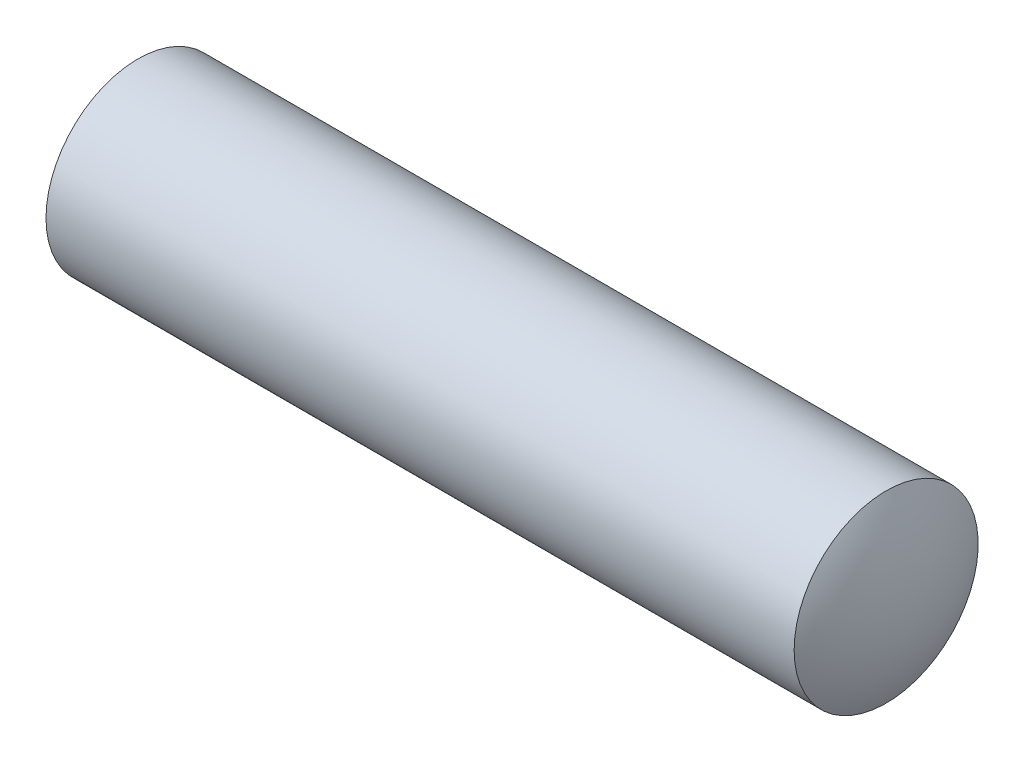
ISO-10303-21;
HEADER;
FILE_DESCRIPTION(('STEP AP214'),'2;1');
FILE_NAME('part.step','',(''),(''),'','','');
FILE_SCHEMA(('AUTOMOTIVE_DESIGN { 1 0 10303 214 1 1 1 1 }'));
ENDSEC;
DATA;
#1=APPLICATION_CONTEXT('core data for automotive mechanical design processes');
#2=APPLICATION_PROTOCOL_DEFINITION('international standard','automotive_design',2000,#1);
#3=PRODUCT_CONTEXT('',#1,'mechanical');
#4=PRODUCT('Part','Part','',(#3));
#5=PRODUCT_RELATED_PRODUCT_CATEGORY('part','',(#4));
#6=PRODUCT_DEFINITION_FORMATION('','',#4);
#7=PRODUCT_DEFINITION_CONTEXT('part definition',#1,'design');
#8=PRODUCT_DEFINITION('design','',#6,#7);
#9=PRODUCT_DEFINITION_SHAPE('','',#8);
#10=(LENGTH_UNIT() NAMED_UNIT(*) SI_UNIT(.MILLI.,.METRE.));
#11=(NAMED_UNIT(*) PLANE_ANGLE_UNIT() SI_UNIT($,.RADIAN.));
#12=(NAMED_UNIT(*) SI_UNIT($,.STERADIAN.) SOLID_ANGLE_UNIT());
#13=UNCERTAINTY_MEASURE_WITH_UNIT(LENGTH_MEASURE(1.E-05),#10,'distance_accuracy_value','');
#14=(GEOMETRIC_REPRESENTATION_CONTEXT(3) GLOBAL_UNCERTAINTY_ASSIGNED_CONTEXT((#13)) GLOBAL_UNIT_ASSIGNED_CONTEXT((#10,
#11,#12)) REPRESENTATION_CONTEXT('',''));
#15=CARTESIAN_POINT('',(0.,0.,0.));
#16=DIRECTION('',(0.,0.,1.));
#17=DIRECTION('',(1.,0.,0.));
#18=AXIS2_PLACEMENT_3D('',#15,#16,#17);
#19=CARTESIAN_POINT('',(6.,0.,0.));
#20=DIRECTION('',(0.,0.,1.));
#21=DIRECTION('',(1.,0.,0.));
#22=AXIS2_PLACEMENT_3D('',#19,#20,#21);
#23=SPHERICAL_SURFACE('',#22,6.);
#24=CARTESIAN_POINT('',(6.,0.,0.));
#25=DIRECTION('',(-1.,0.,0.));
#26=DIRECTION('',(0.,0.,1.));
#27=AXIS2_PLACEMENT_3D('',#24,#25,#26);
#28=SPHERICAL_SURFACE('',#27,6.);
#29=CARTESIAN_POINT('',(0.803847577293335,0.,0.));
#30=DIRECTION('',(-1.,0.,0.));
#31=DIRECTION('',(0.,0.,1.));
#32=AXIS2_PLACEMENT_3D('',#29,#30,#31);
#33=CIRCLE('',#32,3.);
#34=CARTESIAN_POINT('',(0.803847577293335,0.,3.00000000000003));
#35=VERTEX_POINT('',#34);
#36=EDGE_CURVE('E38',#35,#35,#33,.T.);
#37=ORIENTED_EDGE('',*,*,#36,.T.);
#38=EDGE_LOOP('',(#37));
#39=FACE_BOUND('',#38,.T.);
#40=ADVANCED_FACE('F32',(#39),#28,.T.);
#41=CARTESIAN_POINT('',(20.,0.,0.));
#42=DIRECTION('',(0.,0.,1.));
#43=DIRECTION('',(1.,0.,0.));
#44=AXIS2_PLACEMENT_3D('',#41,#42,#43);
#45=SPHERICAL_SURFACE('',#44,6.);
#46=CARTESIAN_POINT('',(20.,0.,0.));
#47=DIRECTION('',(-1.,0.,0.));
#48=DIRECTION('',(0.,0.,1.));
#49=AXIS2_PLACEMENT_3D('',#46,#47,#48);
#50=SPHERICAL_SURFACE('',#49,6.);
#51=CARTESIAN_POINT('',(25.1961524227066,0.,0.));
#52=DIRECTION('',(-1.,0.,0.));
#53=DIRECTION('',(0.,0.,1.));
#54=AXIS2_PLACEMENT_3D('',#51,#52,#53);
#55=CIRCLE('',#54,3.);
#56=CARTESIAN_POINT('',(25.1961524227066,0.,3.00000000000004));
#57=VERTEX_POINT('',#56);
#58=EDGE_CURVE('E10',#57,#57,#55,.T.);
#59=ORIENTED_EDGE('',*,*,#58,.F.);
#60=EDGE_LOOP('',(#59));
#61=FACE_BOUND('',#60,.T.);
#62=ADVANCED_FACE('F47',(#61),#50,.T.);
#63=CARTESIAN_POINT('',(0.,0.,0.));
#64=DIRECTION('',(-1.,0.,0.));
#65=DIRECTION('',(0.,0.,1.));
#66=AXIS2_PLACEMENT_3D('',#63,#64,#65);
#67=CYLINDRICAL_SURFACE('',#66,3.);
#68=ORIENTED_EDGE('',*,*,#58,.T.);
#69=EDGE_LOOP('',(#68));
#70=FACE_BOUND('',#69,.T.);
#71=ORIENTED_EDGE('',*,*,#36,.F.);
#72=EDGE_LOOP('',(#71));
#73=FACE_BOUND('',#72,.T.);
#74=ADVANCED_FACE('F45',(#70,#73),#67,.T.);
#75=CLOSED_SHELL('',(#40,#62,#74));
#76=MANIFOLD_SOLID_BREP('B2',#75);
#77=ADVANCED_BREP_SHAPE_REPRESENTATION('',(#18,#76),#14);
#78=SHAPE_DEFINITION_REPRESENTATION(#9,#77);
ENDSEC;
END-ISO-10303-21;
